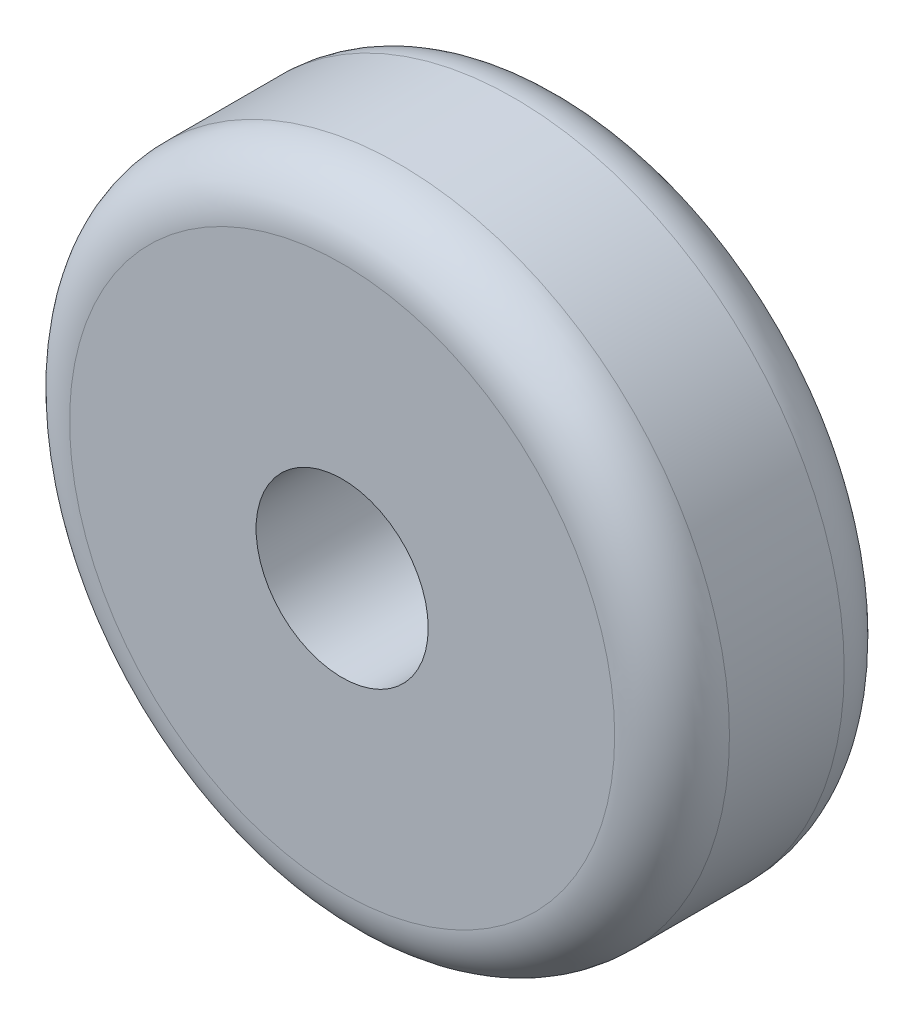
from build123d import *

# Parameters (mm, degrees)
SCHIZZO1_R                   = 5.75
SCHIZZO1_R_2                 = 1.5
ESTRUSIONE_ESTRUSIONE1_DEPTH = 4
RACCORDO1_R                  = 1


with BuildPart() as part:
    # Schizzo1 → Estrusione-Estrusione1 (new body)
    with BuildSketch(Plane.XY):
        Circle(SCHIZZO1_R)
        Circle(SCHIZZO1_R_2, mode=Mode.SUBTRACT)
    extrude(amount=ESTRUSIONE_ESTRUSIONE1_DEPTH)

    # Raccordo1
    raccordo1_edges = [part.edges().sort_by_distance(p)[0] for p in [
        (-5.75, 0, 0),
        (-5.75, 0, 4),
    ]]
    fillet(raccordo1_edges, radius=RACCORDO1_R)


solid = part.part
